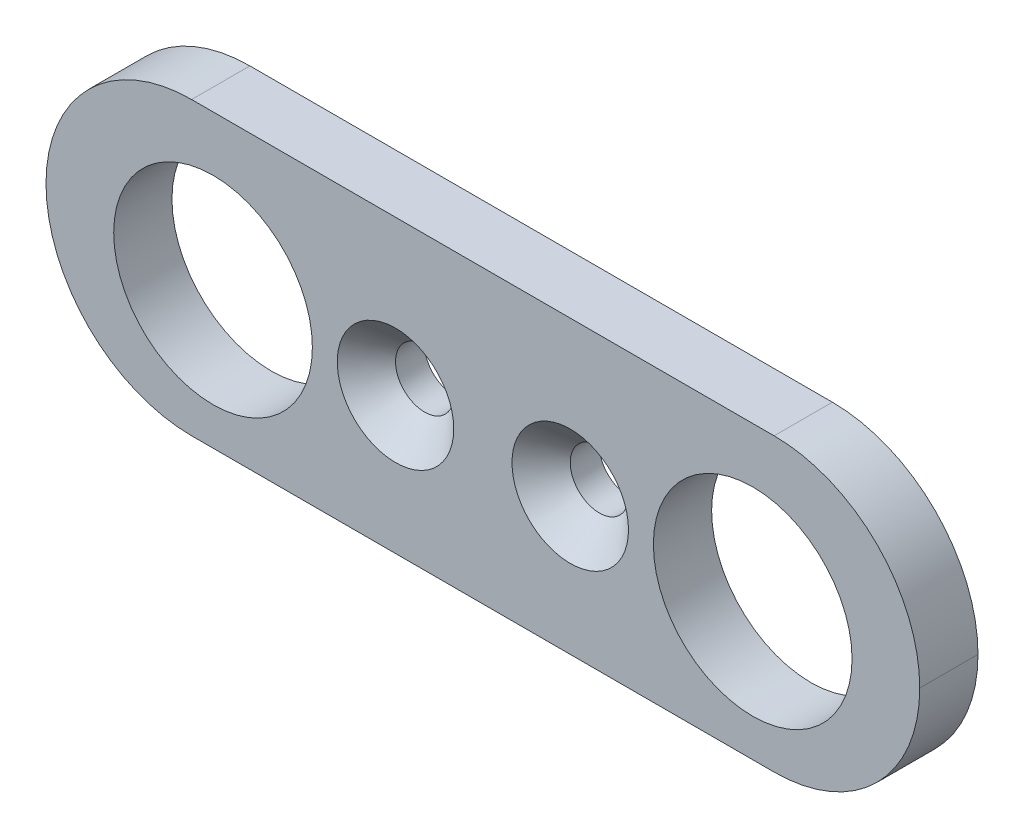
ISO-10303-21;
HEADER;
FILE_DESCRIPTION(('STEP AP214'),'2;1');
FILE_NAME('part.step','',(''),(''),'','','');
FILE_SCHEMA(('AUTOMOTIVE_DESIGN { 1 0 10303 214 1 1 1 1 }'));
ENDSEC;
DATA;
#1=APPLICATION_CONTEXT('core data for automotive mechanical design processes');
#2=APPLICATION_PROTOCOL_DEFINITION('international standard','automotive_design',2000,#1);
#3=PRODUCT_CONTEXT('',#1,'mechanical');
#4=PRODUCT('Part','Part','',(#3));
#5=PRODUCT_RELATED_PRODUCT_CATEGORY('part','',(#4));
#6=PRODUCT_DEFINITION_FORMATION('','',#4);
#7=PRODUCT_DEFINITION_CONTEXT('part definition',#1,'design');
#8=PRODUCT_DEFINITION('design','',#6,#7);
#9=PRODUCT_DEFINITION_SHAPE('','',#8);
#10=(LENGTH_UNIT() NAMED_UNIT(*) SI_UNIT(.MILLI.,.METRE.));
#11=(NAMED_UNIT(*) PLANE_ANGLE_UNIT() SI_UNIT($,.RADIAN.));
#12=(NAMED_UNIT(*) SI_UNIT($,.STERADIAN.) SOLID_ANGLE_UNIT());
#13=UNCERTAINTY_MEASURE_WITH_UNIT(LENGTH_MEASURE(1.E-05),#10,'distance_accuracy_value','');
#14=(GEOMETRIC_REPRESENTATION_CONTEXT(3) GLOBAL_UNCERTAINTY_ASSIGNED_CONTEXT((#13)) GLOBAL_UNIT_ASSIGNED_CONTEXT((#10,
#11,#12)) REPRESENTATION_CONTEXT('',''));
#15=CARTESIAN_POINT('',(0.,0.,0.));
#16=DIRECTION('',(0.,0.,1.));
#17=DIRECTION('',(1.,0.,0.));
#18=AXIS2_PLACEMENT_3D('',#15,#16,#17);
#19=CARTESIAN_POINT('',(-45.,76.0584345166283,4.));
#20=DIRECTION('',(0.,1.,0.));
#21=DIRECTION('',(-1.,0.,0.));
#22=AXIS2_PLACEMENT_3D('',#19,#20,#21);
#23=PLANE('',#22);
#24=DIRECTION('',(1.,0.,0.));
#25=VECTOR('',#24,1.);
#26=CARTESIAN_POINT('',(-45.,76.0584345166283,4.));
#27=LINE('',#26,#25);
#28=CARTESIAN_POINT('',(-35.,76.0584345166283,4.));
#29=VERTEX_POINT('',#28);
#30=CARTESIAN_POINT('',(4.99999999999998,76.0584345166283,4.));
#31=VERTEX_POINT('',#30);
#32=EDGE_CURVE('E114',#29,#31,#27,.T.);
#33=ORIENTED_EDGE('',*,*,#32,.F.);
#34=DIRECTION('',(0.,0.,-1.));
#35=VECTOR('',#34,1.);
#36=CARTESIAN_POINT('',(-35.,76.0584345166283,4.));
#37=LINE('',#36,#35);
#38=CARTESIAN_POINT('',(-35.,76.0584345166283,0.));
#39=VERTEX_POINT('',#38);
#40=EDGE_CURVE('E11',#29,#39,#37,.T.);
#41=ORIENTED_EDGE('',*,*,#40,.T.);
#42=DIRECTION('',(1.,0.,0.));
#43=VECTOR('',#42,1.);
#44=CARTESIAN_POINT('',(-45.,76.0584345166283,0.));
#45=LINE('',#44,#43);
#46=CARTESIAN_POINT('',(4.99999999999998,76.0584345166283,0.));
#47=VERTEX_POINT('',#46);
#48=EDGE_CURVE('E115',#39,#47,#45,.T.);
#49=ORIENTED_EDGE('',*,*,#48,.T.);
#50=DIRECTION('',(0.,0.,-1.));
#51=VECTOR('',#50,1.);
#52=CARTESIAN_POINT('',(4.99999999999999,76.0584345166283,4.));
#53=LINE('',#52,#51);
#54=EDGE_CURVE('E42',#47,#31,#53,.F.);
#55=ORIENTED_EDGE('',*,*,#54,.T.);
#56=EDGE_LOOP('',(#33,#41,#49,#55));
#57=FACE_BOUND('',#56,.T.);
#58=ADVANCED_FACE('F33',(#57),#23,.F.);
#59=CARTESIAN_POINT('',(15.,96.0584345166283,4.));
#60=DIRECTION('',(0.,-1.,0.));
#61=DIRECTION('',(1.,0.,0.));
#62=AXIS2_PLACEMENT_3D('',#59,#60,#61);
#63=PLANE('',#62);
#64=DIRECTION('',(-1.,0.,0.));
#65=VECTOR('',#64,1.);
#66=CARTESIAN_POINT('',(15.,96.0584345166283,4.));
#67=LINE('',#66,#65);
#68=CARTESIAN_POINT('',(4.99999999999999,96.0584345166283,4.));
#69=VERTEX_POINT('',#68);
#70=CARTESIAN_POINT('',(-35.,96.0584345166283,4.));
#71=VERTEX_POINT('',#70);
#72=EDGE_CURVE('E108',#69,#71,#67,.T.);
#73=ORIENTED_EDGE('',*,*,#72,.F.);
#74=DIRECTION('',(0.,0.,-1.));
#75=VECTOR('',#74,1.);
#76=CARTESIAN_POINT('',(4.99999999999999,96.0584345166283,4.));
#77=LINE('',#76,#75);
#78=CARTESIAN_POINT('',(4.99999999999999,96.0584345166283,0.));
#79=VERTEX_POINT('',#78);
#80=EDGE_CURVE('E92',#69,#79,#77,.T.);
#81=ORIENTED_EDGE('',*,*,#80,.T.);
#82=DIRECTION('',(-1.,0.,0.));
#83=VECTOR('',#82,1.);
#84=CARTESIAN_POINT('',(15.,96.0584345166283,0.));
#85=LINE('',#84,#83);
#86=CARTESIAN_POINT('',(-35.,96.0584345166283,0.));
#87=VERTEX_POINT('',#86);
#88=EDGE_CURVE('E105',#79,#87,#85,.T.);
#89=ORIENTED_EDGE('',*,*,#88,.T.);
#90=DIRECTION('',(0.,0.,-1.));
#91=VECTOR('',#90,1.);
#92=CARTESIAN_POINT('',(-35.,96.0584345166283,4.));
#93=LINE('',#92,#91);
#94=EDGE_CURVE('E109',#87,#71,#93,.F.);
#95=ORIENTED_EDGE('',*,*,#94,.T.);
#96=EDGE_LOOP('',(#73,#81,#89,#95));
#97=FACE_BOUND('',#96,.T.);
#98=ADVANCED_FACE('F103',(#97),#63,.F.);
#99=CARTESIAN_POINT('',(0.,0.,4.));
#100=DIRECTION('',(0.,0.,1.));
#101=DIRECTION('',(1.,0.,0.));
#102=AXIS2_PLACEMENT_3D('',#99,#100,#101);
#103=PLANE('',#102);
#104=CARTESIAN_POINT('',(-8.99999999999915,85.4672656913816,4.));
#105=DIRECTION('',(0.,0.,1.));
#106=DIRECTION('',(1.,0.,0.));
#107=AXIS2_PLACEMENT_3D('',#104,#105,#106);
#108=CIRCLE('',#107,4.00000000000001);
#109=CARTESIAN_POINT('',(-4.99999999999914,85.4672656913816,4.));
#110=VERTEX_POINT('',#109);
#111=EDGE_CURVE('E128',#110,#110,#108,.F.);
#112=ORIENTED_EDGE('',*,*,#111,.T.);
#113=EDGE_LOOP('',(#112));
#114=FACE_BOUND('',#113,.T.);
#115=CARTESIAN_POINT('',(-20.9999999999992,85.4672656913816,4.));
#116=DIRECTION('',(0.,0.,1.));
#117=DIRECTION('',(1.,0.,0.));
#118=AXIS2_PLACEMENT_3D('',#115,#116,#117);
#119=CIRCLE('',#118,4.00000000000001);
#120=CARTESIAN_POINT('',(-16.9999999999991,85.4672656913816,4.));
#121=VERTEX_POINT('',#120);
#122=EDGE_CURVE('E125',#121,#121,#119,.F.);
#123=ORIENTED_EDGE('',*,*,#122,.T.);
#124=EDGE_LOOP('',(#123));
#125=FACE_BOUND('',#124,.T.);
#126=CARTESIAN_POINT('',(3.5297703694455,85.4672656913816,4.));
#127=DIRECTION('',(0.,0.,1.));
#128=DIRECTION('',(-1.,0.,0.));
#129=AXIS2_PLACEMENT_3D('',#126,#127,#128);
#130=CIRCLE('',#129,6.82180872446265);
#131=CARTESIAN_POINT('',(-3.29203835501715,85.4672656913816,4.));
#132=VERTEX_POINT('',#131);
#133=EDGE_CURVE('E145',#132,#132,#130,.T.);
#134=ORIENTED_EDGE('',*,*,#133,.F.);
#135=EDGE_LOOP('',(#134));
#136=FACE_BOUND('',#135,.T.);
#137=CARTESIAN_POINT('',(-33.5297703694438,85.4672656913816,4.));
#138=DIRECTION('',(0.,0.,1.));
#139=DIRECTION('',(1.,0.,0.));
#140=AXIS2_PLACEMENT_3D('',#137,#138,#139);
#141=CIRCLE('',#140,6.82180872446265);
#142=CARTESIAN_POINT('',(-26.7079616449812,85.4672656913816,4.));
#143=VERTEX_POINT('',#142);
#144=EDGE_CURVE('E168',#143,#143,#141,.T.);
#145=ORIENTED_EDGE('',*,*,#144,.F.);
#146=EDGE_LOOP('',(#145));
#147=FACE_BOUND('',#146,.T.);
#148=ORIENTED_EDGE('',*,*,#72,.T.);
#149=CARTESIAN_POINT('',(-35.,86.0584345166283,4.));
#150=DIRECTION('',(0.,0.,1.));
#151=DIRECTION('',(1.,0.,0.));
#152=AXIS2_PLACEMENT_3D('',#149,#150,#151);
#153=CIRCLE('',#152,10.);
#154=CARTESIAN_POINT('',(-45.,86.0584345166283,4.));
#155=VERTEX_POINT('',#154);
#156=EDGE_CURVE('E143',#71,#155,#153,.T.);
#157=ORIENTED_EDGE('',*,*,#156,.T.);
#158=CARTESIAN_POINT('',(-35.,86.0584345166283,4.));
#159=DIRECTION('',(0.,0.,1.));
#160=DIRECTION('',(1.,0.,0.));
#161=AXIS2_PLACEMENT_3D('',#158,#159,#160);
#162=CIRCLE('',#161,10.);
#163=EDGE_CURVE('E141',#155,#29,#162,.T.);
#164=ORIENTED_EDGE('',*,*,#163,.T.);
#165=ORIENTED_EDGE('',*,*,#32,.T.);
#166=CARTESIAN_POINT('',(4.99999999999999,86.0584345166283,4.));
#167=DIRECTION('',(0.,0.,1.));
#168=DIRECTION('',(1.,0.,0.));
#169=AXIS2_PLACEMENT_3D('',#166,#167,#168);
#170=CIRCLE('',#169,10.);
#171=CARTESIAN_POINT('',(15.,86.0584345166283,4.));
#172=VERTEX_POINT('',#171);
#173=EDGE_CURVE('E50',#31,#172,#170,.T.);
#174=ORIENTED_EDGE('',*,*,#173,.T.);
#175=CARTESIAN_POINT('',(4.99999999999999,86.0584345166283,4.));
#176=DIRECTION('',(0.,0.,1.));
#177=DIRECTION('',(1.,0.,0.));
#178=AXIS2_PLACEMENT_3D('',#175,#176,#177);
#179=CIRCLE('',#178,10.);
#180=EDGE_CURVE('E139',#172,#69,#179,.T.);
#181=ORIENTED_EDGE('',*,*,#180,.T.);
#182=EDGE_LOOP('',(#148,#157,#164,#165,#174,#181));
#183=FACE_BOUND('',#182,.T.);
#184=ADVANCED_FACE('F157',(#114,#125,#136,#147,#183),#103,.T.);
#185=CARTESIAN_POINT('',(0.,0.,0.));
#186=DIRECTION('',(0.,0.,1.));
#187=DIRECTION('',(1.,0.,0.));
#188=AXIS2_PLACEMENT_3D('',#185,#186,#187);
#189=PLANE('',#188);
#190=CARTESIAN_POINT('',(3.5297703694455,85.4672656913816,0.));
#191=DIRECTION('',(0.,0.,1.));
#192=DIRECTION('',(-1.,0.,0.));
#193=AXIS2_PLACEMENT_3D('',#190,#191,#192);
#194=CIRCLE('',#193,6.82180872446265);
#195=CARTESIAN_POINT('',(-3.29203835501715,85.4672656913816,0.));
#196=VERTEX_POINT('',#195);
#197=EDGE_CURVE('E147',#196,#196,#194,.T.);
#198=ORIENTED_EDGE('',*,*,#197,.T.);
#199=EDGE_LOOP('',(#198));
#200=FACE_BOUND('',#199,.T.);
#201=CARTESIAN_POINT('',(-33.5297703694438,85.4672656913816,0.));
#202=DIRECTION('',(0.,0.,1.));
#203=DIRECTION('',(1.,0.,0.));
#204=AXIS2_PLACEMENT_3D('',#201,#202,#203);
#205=CIRCLE('',#204,6.82180872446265);
#206=CARTESIAN_POINT('',(-26.7079616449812,85.4672656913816,0.));
#207=VERTEX_POINT('',#206);
#208=EDGE_CURVE('E167',#207,#207,#205,.T.);
#209=ORIENTED_EDGE('',*,*,#208,.T.);
#210=EDGE_LOOP('',(#209));
#211=FACE_BOUND('',#210,.T.);
#212=CARTESIAN_POINT('',(-8.99999999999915,85.4672656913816,0.));
#213=DIRECTION('',(0.,0.,1.));
#214=DIRECTION('',(-1.,0.,0.));
#215=AXIS2_PLACEMENT_3D('',#212,#213,#214);
#216=CIRCLE('',#215,2.);
#217=CARTESIAN_POINT('',(-10.9999999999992,85.4672656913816,0.));
#218=VERTEX_POINT('',#217);
#219=EDGE_CURVE('E164',#218,#218,#216,.T.);
#220=ORIENTED_EDGE('',*,*,#219,.T.);
#221=EDGE_LOOP('',(#220));
#222=FACE_BOUND('',#221,.T.);
#223=CARTESIAN_POINT('',(-20.9999999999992,85.4672656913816,0.));
#224=DIRECTION('',(0.,0.,1.));
#225=DIRECTION('',(1.,0.,0.));
#226=AXIS2_PLACEMENT_3D('',#223,#224,#225);
#227=CIRCLE('',#226,2.);
#228=CARTESIAN_POINT('',(-18.9999999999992,85.4672656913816,0.));
#229=VERTEX_POINT('',#228);
#230=EDGE_CURVE('E118',#229,#229,#227,.T.);
#231=ORIENTED_EDGE('',*,*,#230,.T.);
#232=EDGE_LOOP('',(#231));
#233=FACE_BOUND('',#232,.T.);
#234=CARTESIAN_POINT('',(-35.,86.0584345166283,0.));
#235=DIRECTION('',(0.,0.,1.));
#236=DIRECTION('',(1.,0.,0.));
#237=AXIS2_PLACEMENT_3D('',#234,#235,#236);
#238=CIRCLE('',#237,10.);
#239=CARTESIAN_POINT('',(-45.,86.0584345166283,0.));
#240=VERTEX_POINT('',#239);
#241=EDGE_CURVE('E97',#39,#240,#238,.F.);
#242=ORIENTED_EDGE('',*,*,#241,.T.);
#243=CARTESIAN_POINT('',(-35.,86.0584345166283,0.));
#244=DIRECTION('',(0.,0.,1.));
#245=DIRECTION('',(1.,0.,0.));
#246=AXIS2_PLACEMENT_3D('',#243,#244,#245);
#247=CIRCLE('',#246,10.);
#248=EDGE_CURVE('E113',#240,#87,#247,.F.);
#249=ORIENTED_EDGE('',*,*,#248,.T.);
#250=ORIENTED_EDGE('',*,*,#88,.F.);
#251=CARTESIAN_POINT('',(4.99999999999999,86.0584345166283,0.));
#252=DIRECTION('',(0.,0.,1.));
#253=DIRECTION('',(1.,0.,0.));
#254=AXIS2_PLACEMENT_3D('',#251,#252,#253);
#255=CIRCLE('',#254,10.);
#256=CARTESIAN_POINT('',(15.,86.0584345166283,0.));
#257=VERTEX_POINT('',#256);
#258=EDGE_CURVE('E88',#79,#257,#255,.F.);
#259=ORIENTED_EDGE('',*,*,#258,.T.);
#260=CARTESIAN_POINT('',(4.99999999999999,86.0584345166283,0.));
#261=DIRECTION('',(0.,0.,1.));
#262=DIRECTION('',(1.,0.,0.));
#263=AXIS2_PLACEMENT_3D('',#260,#261,#262);
#264=CIRCLE('',#263,10.);
#265=EDGE_CURVE('E98',#257,#47,#264,.F.);
#266=ORIENTED_EDGE('',*,*,#265,.T.);
#267=ORIENTED_EDGE('',*,*,#48,.F.);
#268=EDGE_LOOP('',(#242,#249,#250,#259,#266,#267));
#269=FACE_BOUND('',#268,.T.);
#270=ADVANCED_FACE('F111',(#200,#211,#222,#233,#269),#189,.F.);
#271=CARTESIAN_POINT('',(-20.9999999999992,85.4672656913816,0.));
#272=DIRECTION('',(0.,0.,1.));
#273=DIRECTION('',(1.,0.,0.));
#274=AXIS2_PLACEMENT_3D('',#271,#272,#273);
#275=CYLINDRICAL_SURFACE('',#274,2.);
#276=CARTESIAN_POINT('',(-20.9999999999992,85.4672656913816,1.99999999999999));
#277=DIRECTION('',(0.,0.,1.));
#278=DIRECTION('',(1.,0.,0.));
#279=AXIS2_PLACEMENT_3D('',#276,#277,#278);
#280=CIRCLE('',#279,2.);
#281=CARTESIAN_POINT('',(-18.9999999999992,85.4672656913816,1.99999999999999));
#282=VERTEX_POINT('',#281);
#283=EDGE_CURVE('E131',#282,#282,#280,.T.);
#284=ORIENTED_EDGE('',*,*,#283,.T.);
#285=EDGE_LOOP('',(#284));
#286=FACE_BOUND('',#285,.T.);
#287=ORIENTED_EDGE('',*,*,#230,.F.);
#288=EDGE_LOOP('',(#287));
#289=FACE_BOUND('',#288,.T.);
#290=ADVANCED_FACE('F199',(#286,#289),#275,.F.);
#291=CARTESIAN_POINT('',(-8.99999999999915,85.4672656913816,0.));
#292=DIRECTION('',(0.,0.,1.));
#293=DIRECTION('',(1.,0.,0.));
#294=AXIS2_PLACEMENT_3D('',#291,#292,#293);
#295=CYLINDRICAL_SURFACE('',#294,2.);
#296=CARTESIAN_POINT('',(-8.99999999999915,85.4672656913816,1.99999999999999));
#297=DIRECTION('',(0.,0.,1.));
#298=DIRECTION('',(1.,0.,0.));
#299=AXIS2_PLACEMENT_3D('',#296,#297,#298);
#300=CIRCLE('',#299,2.);
#301=CARTESIAN_POINT('',(-6.99999999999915,85.4672656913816,1.99999999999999));
#302=VERTEX_POINT('',#301);
#303=EDGE_CURVE('E122',#302,#302,#300,.T.);
#304=ORIENTED_EDGE('',*,*,#303,.T.);
#305=EDGE_LOOP('',(#304));
#306=FACE_BOUND('',#305,.T.);
#307=ORIENTED_EDGE('',*,*,#219,.F.);
#308=EDGE_LOOP('',(#307));
#309=FACE_BOUND('',#308,.T.);
#310=ADVANCED_FACE('F193',(#306,#309),#295,.F.);
#311=CARTESIAN_POINT('',(-33.5297703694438,85.4672656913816,0.));
#312=DIRECTION('',(0.,0.,1.));
#313=DIRECTION('',(1.,0.,0.));
#314=AXIS2_PLACEMENT_3D('',#311,#312,#313);
#315=CYLINDRICAL_SURFACE('',#314,6.82180872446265);
#316=ORIENTED_EDGE('',*,*,#208,.F.);
#317=EDGE_LOOP('',(#316));
#318=FACE_BOUND('',#317,.T.);
#319=ORIENTED_EDGE('',*,*,#144,.T.);
#320=EDGE_LOOP('',(#319));
#321=FACE_BOUND('',#320,.T.);
#322=ADVANCED_FACE('F182',(#318,#321),#315,.F.);
#323=CARTESIAN_POINT('',(3.5297703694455,85.4672656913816,0.));
#324=DIRECTION('',(0.,0.,1.));
#325=DIRECTION('',(1.,0.,0.));
#326=AXIS2_PLACEMENT_3D('',#323,#324,#325);
#327=CYLINDRICAL_SURFACE('',#326,6.82180872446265);
#328=ORIENTED_EDGE('',*,*,#197,.F.);
#329=EDGE_LOOP('',(#328));
#330=FACE_BOUND('',#329,.T.);
#331=ORIENTED_EDGE('',*,*,#133,.T.);
#332=EDGE_LOOP('',(#331));
#333=FACE_BOUND('',#332,.T.);
#334=ADVANCED_FACE('F178',(#330,#333),#327,.F.);
#335=CARTESIAN_POINT('',(-8.99999999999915,85.4672656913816,1.99999999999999));
#336=DIRECTION('',(0.,0.,1.));
#337=DIRECTION('',(1.,0.,0.));
#338=AXIS2_PLACEMENT_3D('',#335,#336,#337);
#339=CONICAL_SURFACE('',#338,2.,0.785398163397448);
#340=ORIENTED_EDGE('',*,*,#111,.F.);
#341=EDGE_LOOP('',(#340));
#342=FACE_BOUND('',#341,.T.);
#343=ORIENTED_EDGE('',*,*,#303,.F.);
#344=EDGE_LOOP('',(#343));
#345=FACE_BOUND('',#344,.T.);
#346=ADVANCED_FACE('F181',(#342,#345),#339,.F.);
#347=CARTESIAN_POINT('',(-20.9999999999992,85.4672656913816,1.99999999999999));
#348=DIRECTION('',(0.,0.,1.));
#349=DIRECTION('',(1.,0.,0.));
#350=AXIS2_PLACEMENT_3D('',#347,#348,#349);
#351=CONICAL_SURFACE('',#350,2.,0.785398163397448);
#352=ORIENTED_EDGE('',*,*,#122,.F.);
#353=EDGE_LOOP('',(#352));
#354=FACE_BOUND('',#353,.T.);
#355=ORIENTED_EDGE('',*,*,#283,.F.);
#356=EDGE_LOOP('',(#355));
#357=FACE_BOUND('',#356,.T.);
#358=ADVANCED_FACE('F213',(#354,#357),#351,.F.);
#359=CARTESIAN_POINT('',(4.99999999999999,86.0584345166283,4.));
#360=DIRECTION('',(0.,0.,-1.));
#361=DIRECTION('',(-1.,0.,0.));
#362=AXIS2_PLACEMENT_3D('',#359,#360,#361);
#363=CYLINDRICAL_SURFACE('',#362,10.);
#364=DIRECTION('',(0.,0.,-1.));
#365=VECTOR('',#364,1.);
#366=CARTESIAN_POINT('',(15.,86.0584345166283,4.));
#367=LINE('',#366,#365);
#368=EDGE_CURVE('E93',#172,#257,#367,.T.);
#369=ORIENTED_EDGE('',*,*,#368,.F.);
#370=ORIENTED_EDGE('',*,*,#173,.F.);
#371=ORIENTED_EDGE('',*,*,#54,.F.);
#372=ORIENTED_EDGE('',*,*,#265,.F.);
#373=EDGE_LOOP('',(#369,#370,#371,#372));
#374=FACE_BOUND('',#373,.T.);
#375=ADVANCED_FACE('F160',(#374),#363,.T.);
#376=CARTESIAN_POINT('',(4.99999999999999,86.0584345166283,4.));
#377=DIRECTION('',(0.,0.,-1.));
#378=DIRECTION('',(-1.,0.,0.));
#379=AXIS2_PLACEMENT_3D('',#376,#377,#378);
#380=CYLINDRICAL_SURFACE('',#379,10.);
#381=ORIENTED_EDGE('',*,*,#180,.F.);
#382=ORIENTED_EDGE('',*,*,#368,.T.);
#383=ORIENTED_EDGE('',*,*,#258,.F.);
#384=ORIENTED_EDGE('',*,*,#80,.F.);
#385=EDGE_LOOP('',(#381,#382,#383,#384));
#386=FACE_BOUND('',#385,.T.);
#387=ADVANCED_FACE('F91',(#386),#380,.T.);
#388=CARTESIAN_POINT('',(-35.,86.0584345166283,4.));
#389=DIRECTION('',(0.,0.,-1.));
#390=DIRECTION('',(-1.,0.,0.));
#391=AXIS2_PLACEMENT_3D('',#388,#389,#390);
#392=CYLINDRICAL_SURFACE('',#391,10.);
#393=ORIENTED_EDGE('',*,*,#40,.F.);
#394=ORIENTED_EDGE('',*,*,#163,.F.);
#395=DIRECTION('',(0.,0.,-1.));
#396=VECTOR('',#395,1.);
#397=CARTESIAN_POINT('',(-45.,86.0584345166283,4.));
#398=LINE('',#397,#396);
#399=EDGE_CURVE('E37',#240,#155,#398,.F.);
#400=ORIENTED_EDGE('',*,*,#399,.F.);
#401=ORIENTED_EDGE('',*,*,#241,.F.);
#402=EDGE_LOOP('',(#393,#394,#400,#401));
#403=FACE_BOUND('',#402,.T.);
#404=ADVANCED_FACE('F35',(#403),#392,.T.);
#405=CARTESIAN_POINT('',(-35.,86.0584345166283,4.));
#406=DIRECTION('',(0.,0.,-1.));
#407=DIRECTION('',(-1.,0.,0.));
#408=AXIS2_PLACEMENT_3D('',#405,#406,#407);
#409=CYLINDRICAL_SURFACE('',#408,10.);
#410=ORIENTED_EDGE('',*,*,#156,.F.);
#411=ORIENTED_EDGE('',*,*,#94,.F.);
#412=ORIENTED_EDGE('',*,*,#248,.F.);
#413=ORIENTED_EDGE('',*,*,#399,.T.);
#414=EDGE_LOOP('',(#410,#411,#412,#413));
#415=FACE_BOUND('',#414,.T.);
#416=ADVANCED_FACE('F152',(#415),#409,.T.);
#417=CLOSED_SHELL('',(#58,#98,#184,#270,#290,#310,#322,#334,#346,#358,#375,#387,#404,#416));
#418=MANIFOLD_SOLID_BREP('B2',#417);
#419=ADVANCED_BREP_SHAPE_REPRESENTATION('',(#18,#418),#14);
#420=SHAPE_DEFINITION_REPRESENTATION(#9,#419);
ENDSEC;
END-ISO-10303-21;
